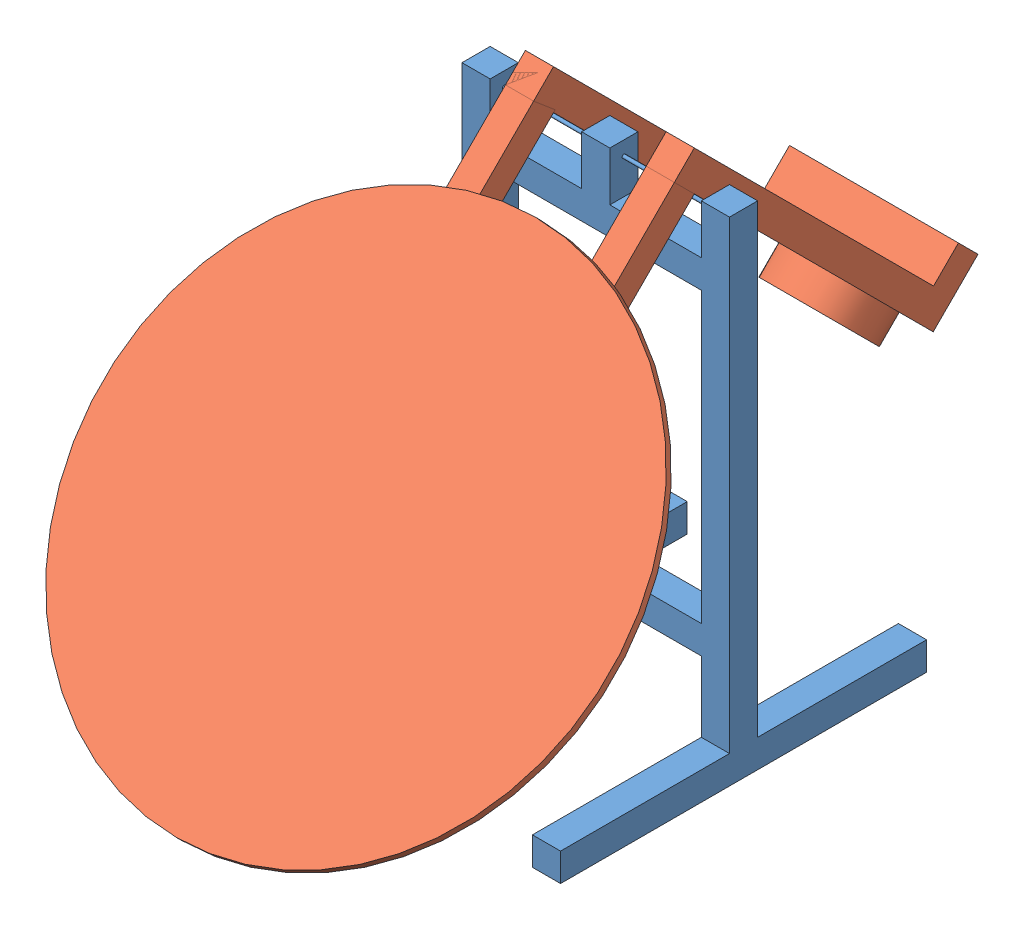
SolidWorks assembly assemblage balance.SLDASM, configuration Défaut (file format 10000). Lengths in mm.
Overall size (457.2 469.97 646.58).
2 component instances, 2 part files, 4 mates.
Components (placement in the parent):
- bati-1: bati.SLDPRT [Défaut] at (-149.8105 -236.4566 444.5) size (241.3 444.5 330.2)
- balance-1: balance.SLDPRT [Défaut] at (21.6395 202.8489 457.2) x (0 0 -1) z (1 0 0) size (646.58 386.15 457.2)
Mates (geometry in assembly coordinates):
- Tangent2: tangent anti-aligned: cylinder of bati-1 through (499850.1895 182.6434 444.5) axis (-1 0 0) radius 1.5875; plane of balance-1 through (34.3395 -30.6377 660.0261) normal (0 -0.707107 -0.707107)
- Tangent3: tangent anti-aligned: cylinder of bati-1 through (499850.1895 182.6434 444.5) axis (-1 0 0) radius 1.5875; plane of balance-1 through (34.3395 -30.6377 228.9739) normal (0 -0.707107 0.707107)
- Distance1: distance = 44.45 mm aligned: plane of bati-1 through (78.7895 -249.1566 609.6) normal (1 0 0); plane of balance-1 through (34.3395 -30.6377 228.9739) normal (1 0 0)
- Angle1: planar angle = 0.785398 rad aligned: plane of balance-1 through (-41.8605 0.7932 673.4965) normal (0 0.707107 0.707107); plane of assembly through (0 0 0) normal (0 1 0)
